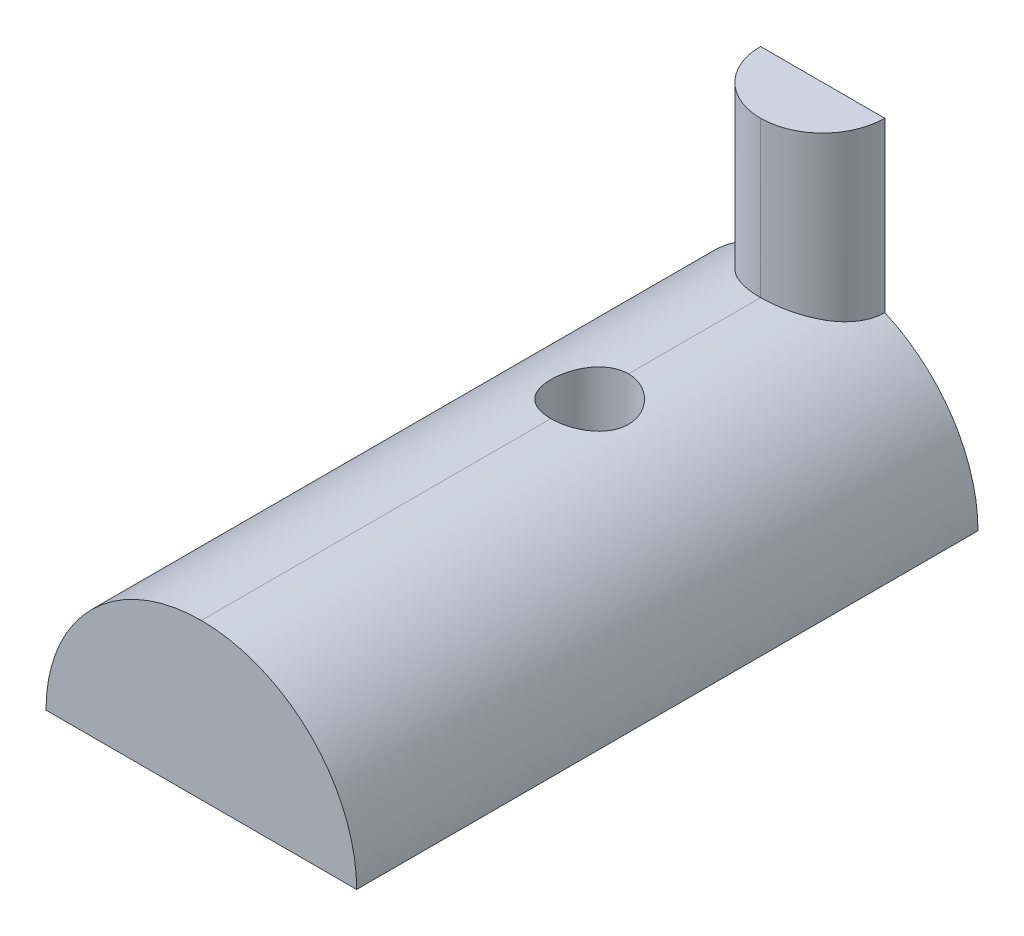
from build123d import *

# Parameters (mm, degrees)
BOSS_EXTRUDE1_DEPTH = 5080
BOSS_EXTRUDE2_DEPTH = 2540
SKETCH3_R           = 317.5
CUT_EXTRUDE1_DEPTH  = 5820.871132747


with BuildPart() as part:
    # Sketch1 → Boss-Extrude1 (new body)
    with BuildSketch(Plane.XY):
        with BuildLine():
            Line((-1270, 0), (1270, 0))
            ThreePointArc((1270, 0), (0, 1270), (-1270, 0))
        make_face()
    extrude(amount=BOSS_EXTRUDE1_DEPTH)

    # Sketch2 → Boss-Extrude2 (add)
    with BuildSketch(Plane.XZ):
        with BuildLine():
            Line((508, 0), (-508, 0))
            ThreePointArc((-508, 0), (0, 508), (508, 0))
        make_face()
    extrude(amount=-BOSS_EXTRUDE2_DEPTH)

    # Sketch3 → Cut-Extrude1 (cut, through all)
    with BuildSketch(Plane.XZ):
        with Locations(Location((0, 1905, 0), (0, 0, 270))):
            Circle(SKETCH3_R)
    extrude(amount=-CUT_EXTRUDE1_DEPTH, mode=Mode.SUBTRACT)


solid = part.part
